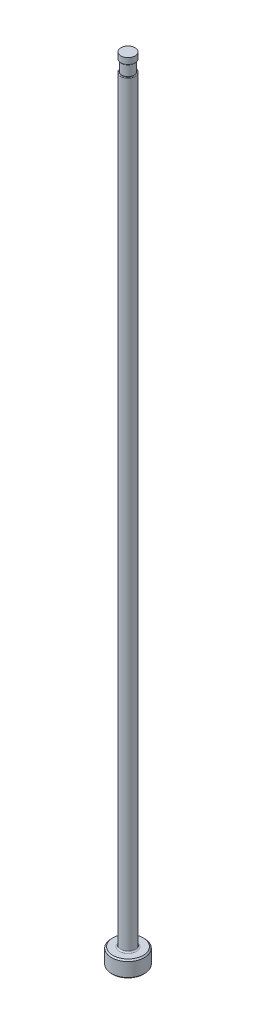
ISO-10303-21;
HEADER;
FILE_DESCRIPTION(('STEP AP214'),'2;1');
FILE_NAME('part.step','',(''),(''),'','','');
FILE_SCHEMA(('AUTOMOTIVE_DESIGN { 1 0 10303 214 1 1 1 1 }'));
ENDSEC;
DATA;
#1=APPLICATION_CONTEXT('core data for automotive mechanical design processes');
#2=APPLICATION_PROTOCOL_DEFINITION('international standard','automotive_design',2000,#1);
#3=PRODUCT_CONTEXT('',#1,'mechanical');
#4=PRODUCT('Part','Part','',(#3));
#5=PRODUCT_RELATED_PRODUCT_CATEGORY('part','',(#4));
#6=PRODUCT_DEFINITION_FORMATION('','',#4);
#7=PRODUCT_DEFINITION_CONTEXT('part definition',#1,'design');
#8=PRODUCT_DEFINITION('design','',#6,#7);
#9=PRODUCT_DEFINITION_SHAPE('','',#8);
#10=(LENGTH_UNIT() NAMED_UNIT(*) SI_UNIT(.MILLI.,.METRE.));
#11=(NAMED_UNIT(*) PLANE_ANGLE_UNIT() SI_UNIT($,.RADIAN.));
#12=(NAMED_UNIT(*) SI_UNIT($,.STERADIAN.) SOLID_ANGLE_UNIT());
#13=UNCERTAINTY_MEASURE_WITH_UNIT(LENGTH_MEASURE(1.E-05),#10,'distance_accuracy_value','');
#14=(GEOMETRIC_REPRESENTATION_CONTEXT(3) GLOBAL_UNCERTAINTY_ASSIGNED_CONTEXT((#13)) GLOBAL_UNIT_ASSIGNED_CONTEXT((#10,
#11,#12)) REPRESENTATION_CONTEXT('',''));
#15=CARTESIAN_POINT('',(0.,0.,0.));
#16=DIRECTION('',(0.,0.,1.));
#17=DIRECTION('',(1.,0.,0.));
#18=AXIS2_PLACEMENT_3D('',#15,#16,#17);
#19=CARTESIAN_POINT('',(-1.38810999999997,151.13,0.));
#20=DIRECTION('',(0.,1.,0.));
#21=DIRECTION('',(0.,0.,1.));
#22=AXIS2_PLACEMENT_3D('',#19,#20,#21);
#23=PLANE('',#22);
#24=CARTESIAN_POINT('',(0.,151.13,0.));
#25=DIRECTION('',(0.,1.,0.));
#26=DIRECTION('',(0.,0.,1.));
#27=AXIS2_PLACEMENT_3D('',#24,#25,#26);
#28=CIRCLE('',#27,1.24205999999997);
#29=CARTESIAN_POINT('',(0.,151.13,1.24205999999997));
#30=VERTEX_POINT('',#29);
#31=EDGE_CURVE('E11',#30,#30,#28,.F.);
#32=ORIENTED_EDGE('',*,*,#31,.T.);
#33=EDGE_LOOP('',(#32));
#34=FACE_BOUND('',#33,.T.);
#35=CARTESIAN_POINT('',(0.,151.13,0.));
#36=DIRECTION('',(0.,1.,0.));
#37=DIRECTION('',(0.,0.,1.));
#38=AXIS2_PLACEMENT_3D('',#35,#36,#37);
#39=CIRCLE('',#38,1.18490999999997);
#40=CARTESIAN_POINT('',(0.,151.13,1.18490999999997));
#41=VERTEX_POINT('',#40);
#42=EDGE_CURVE('E78',#41,#41,#39,.T.);
#43=ORIENTED_EDGE('',*,*,#42,.T.);
#44=EDGE_LOOP('',(#43));
#45=FACE_BOUND('',#44,.T.);
#46=ADVANCED_FACE('F36',(#34,#45),#23,.F.);
#47=CARTESIAN_POINT('',(0.,259.958771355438,0.));
#48=DIRECTION('',(0.,1.,0.));
#49=DIRECTION('',(0.,0.,1.));
#50=AXIS2_PLACEMENT_3D('',#47,#48,#49);
#51=CYLINDRICAL_SURFACE('',#50,1.38810999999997);
#52=DIRECTION('',(0.,1.,0.));
#53=VECTOR('',#52,1.);
#54=CARTESIAN_POINT('',(-1.18490999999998,259.958771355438,-0.723075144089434));
#55=LINE('',#54,#53);
#56=CARTESIAN_POINT('',(-1.18490999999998,148.971,-0.723075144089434));
#57=VERTEX_POINT('',#56);
#58=CARTESIAN_POINT('',(-1.18490999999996,86.614,-0.723075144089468));
#59=VERTEX_POINT('',#58);
#60=EDGE_CURVE('E73',#57,#59,#55,.F.);
#61=ORIENTED_EDGE('',*,*,#60,.F.);
#62=CARTESIAN_POINT('',(0.,148.971,0.));
#63=DIRECTION('',(0.,-1.,0.));
#64=DIRECTION('',(0.,0.,-1.));
#65=AXIS2_PLACEMENT_3D('',#62,#63,#64);
#66=CIRCLE('',#65,1.38810999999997);
#67=CARTESIAN_POINT('',(-1.18490999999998,148.971,0.723075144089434));
#68=VERTEX_POINT('',#67);
#69=EDGE_CURVE('E51',#57,#68,#66,.T.);
#70=ORIENTED_EDGE('',*,*,#69,.T.);
#71=DIRECTION('',(0.,1.,0.));
#72=VECTOR('',#71,1.);
#73=CARTESIAN_POINT('',(-1.18490999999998,259.958771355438,0.723075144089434));
#74=LINE('',#73,#72);
#75=CARTESIAN_POINT('',(-1.18490999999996,86.614,0.723075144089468));
#76=VERTEX_POINT('',#75);
#77=EDGE_CURVE('E84',#76,#68,#74,.T.);
#78=ORIENTED_EDGE('',*,*,#77,.F.);
#79=CARTESIAN_POINT('',(-1.18490999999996,86.614,-0.723075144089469));
#80=CARTESIAN_POINT('',(-1.18490489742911,86.5732205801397,-0.723062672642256));
#81=CARTESIAN_POINT('',(-1.18569554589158,86.5324368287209,-0.721787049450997));
#82=CARTESIAN_POINT('',(-1.18883387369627,86.4510484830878,-0.716617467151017));
#83=CARTESIAN_POINT('',(-1.1911833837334,86.4104441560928,-0.712720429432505));
#84=CARTESIAN_POINT('',(-1.19743938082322,86.3292508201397,-0.702157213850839));
#85=CARTESIAN_POINT('',(-1.20136288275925,86.2886669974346,-0.695460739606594));
#86=CARTESIAN_POINT('',(-1.21067765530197,86.2082938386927,-0.67911480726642));
#87=CARTESIAN_POINT('',(-1.2160681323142,86.1685040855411,-0.669466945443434));
#88=CARTESIAN_POINT('',(-1.23107456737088,86.0713821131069,-0.641613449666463));
#89=CARTESIAN_POINT('',(-1.24148150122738,86.0146925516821,-0.621519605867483));
#90=CARTESIAN_POINT('',(-1.26447851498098,85.9054679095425,-0.573286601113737));
#91=CARTESIAN_POINT('',(-1.27705975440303,85.8529172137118,-0.545179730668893));
#92=CARTESIAN_POINT('',(-1.299036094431,85.7696552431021,-0.48983438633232));
#93=CARTESIAN_POINT('',(-1.30819937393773,85.7372483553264,-0.465065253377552));
#94=CARTESIAN_POINT('',(-1.32626857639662,85.6766429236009,-0.410706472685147));
#95=CARTESIAN_POINT('',(-1.3351748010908,85.6484392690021,-0.381122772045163));
#96=CARTESIAN_POINT('',(-1.35001998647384,85.6032436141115,-0.323985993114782));
#97=CARTESIAN_POINT('',(-1.35618457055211,85.5851455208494,-0.297371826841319));
#98=CARTESIAN_POINT('',(-1.36726162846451,85.553356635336,-0.241365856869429));
#99=CARTESIAN_POINT('',(-1.37217474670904,85.539663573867,-0.21197549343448));
#100=CARTESIAN_POINT('',(-1.38024868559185,85.5174660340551,-0.150740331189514));
#101=CARTESIAN_POINT('',(-1.38339384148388,85.5090078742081,-0.118876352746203));
#102=CARTESIAN_POINT('',(-1.38743875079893,85.4981704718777,-0.0539942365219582));
#103=CARTESIAN_POINT('',(-1.38834050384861,85.4957858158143,-0.0209771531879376));
#104=CARTESIAN_POINT('',(-1.38781595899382,85.4971829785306,0.0402827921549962));
#105=CARTESIAN_POINT('',(-1.38669623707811,85.5001526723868,0.0685504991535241));
#106=CARTESIAN_POINT('',(-1.38282885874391,85.5105312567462,0.124136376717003));
#107=CARTESIAN_POINT('',(-1.38008112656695,85.5179403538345,0.15145450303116));
#108=CARTESIAN_POINT('',(-1.37323772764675,85.536729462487,0.204400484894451));
#109=CARTESIAN_POINT('',(-1.36914590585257,85.5480981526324,0.230032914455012));
#110=CARTESIAN_POINT('',(-1.35995546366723,85.5742451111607,0.279283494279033));
#111=CARTESIAN_POINT('',(-1.35485642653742,85.5890247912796,0.302900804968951));
#112=CARTESIAN_POINT('',(-1.34133825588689,85.6293722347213,0.358961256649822));
#113=CARTESIAN_POINT('',(-1.33251649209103,85.6566776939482,0.390059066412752));
#114=CARTESIAN_POINT('',(-1.31441262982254,85.7159257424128,0.447296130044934));
#115=CARTESIAN_POINT('',(-1.3051296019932,85.747877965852,0.473424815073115));
#116=CARTESIAN_POINT('',(-1.28282911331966,85.8299694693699,0.531562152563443));
#117=CARTESIAN_POINT('',(-1.26997193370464,85.8819111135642,0.561075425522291));
#118=CARTESIAN_POINT('',(-1.24628723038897,85.9902374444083,0.611885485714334));
#119=CARTESIAN_POINT('',(-1.23546851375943,86.0466399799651,0.633147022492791));
#120=CARTESIAN_POINT('',(-1.2193975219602,86.1454407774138,0.663412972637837));
#121=CARTESIAN_POINT('',(-1.21343915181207,86.1872026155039,0.674183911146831));
#122=CARTESIAN_POINT('',(-1.20313242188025,86.2716684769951,0.692410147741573));
#123=CARTESIAN_POINT('',(-1.19878518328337,86.3143731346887,0.699863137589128));
#124=CARTESIAN_POINT('',(-1.19185743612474,86.3998039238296,0.711598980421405));
#125=CARTESIAN_POINT('',(-1.18925556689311,86.4425231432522,0.715920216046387));
#126=CARTESIAN_POINT('',(-1.18577996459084,86.5281637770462,0.721648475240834));
#127=CARTESIAN_POINT('',(-1.18490366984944,86.5710847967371,0.723059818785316));
#128=CARTESIAN_POINT('',(-1.18490999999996,86.614,0.723075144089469));
#129=B_SPLINE_CURVE_WITH_KNOTS('',3,(#79,#80,#81,#82,#83,#84,#85,#86,#87,#88,#89,#90,#91,#92,
#93,#94,#95,#96,#97,#98,#99,#100,#101,#102,#103,#104,#105,#106,#107,#108,#109,#110,#111,#112,
#113,#114,#115,#116,#117,#118,#119,#120,#121,#122,#123,#124,#125,#126,#127,#128),.UNSPECIFIED.,
.F.,.F.,(4,2,2,2,2,2,2,2,2,2,2,2,2,2,2,2,2,2,2,2,2,2,2,2,4),(0.,0.122317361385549,
0.244778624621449,0.368600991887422,0.492356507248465,0.674882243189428,0.856682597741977,
0.981714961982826,1.10659403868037,1.20453097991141,1.30241738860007,1.40115795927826,
1.49981048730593,1.58473133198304,1.66965612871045,1.75434007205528,1.83905912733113,
1.96528739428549,2.09178120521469,2.27410969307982,2.45720871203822,2.58766049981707,
2.71820289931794,2.84711699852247,2.97583957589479),.UNSPECIFIED.);
#130=EDGE_CURVE('E81',#59,#76,#129,.T.);
#131=ORIENTED_EDGE('',*,*,#130,.F.);
#132=EDGE_LOOP('',(#61,#70,#78,#131));
#133=FACE_BOUND('',#132,.T.);
#134=CARTESIAN_POINT('',(0.,3.42900000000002,0.));
#135=DIRECTION('',(0.,1.,0.));
#136=DIRECTION('',(0.,0.,1.));
#137=AXIS2_PLACEMENT_3D('',#134,#135,#136);
#138=CIRCLE('',#137,1.38810999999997);
#139=CARTESIAN_POINT('',(0.,3.42900000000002,1.38810999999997));
#140=VERTEX_POINT('',#139);
#141=EDGE_CURVE('E116',#140,#140,#138,.T.);
#142=ORIENTED_EDGE('',*,*,#141,.T.);
#143=EDGE_LOOP('',(#142));
#144=FACE_BOUND('',#143,.T.);
#145=ADVANCED_FACE('F82',(#133,#144),#51,.T.);
#146=CARTESIAN_POINT('',(0.,0.,0.));
#147=DIRECTION('',(0.,-1.,0.));
#148=DIRECTION('',(0.,0.,-1.));
#149=AXIS2_PLACEMENT_3D('',#146,#147,#148);
#150=PLANE('',#149);
#151=CARTESIAN_POINT('',(0.,0.,0.));
#152=DIRECTION('',(0.,-1.,0.));
#153=DIRECTION('',(0.,0.,-1.));
#154=AXIS2_PLACEMENT_3D('',#151,#152,#153);
#155=CIRCLE('',#154,2.92099999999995);
#156=CARTESIAN_POINT('',(0.,0.,-2.92099999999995));
#157=VERTEX_POINT('',#156);
#158=EDGE_CURVE('E113',#157,#157,#155,.T.);
#159=ORIENTED_EDGE('',*,*,#158,.T.);
#160=EDGE_LOOP('',(#159));
#161=FACE_BOUND('',#160,.T.);
#162=ADVANCED_FACE('F192',(#161),#150,.T.);
#163=CARTESIAN_POINT('',(0.,259.958771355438,0.));
#164=DIRECTION('',(0.,1.,0.));
#165=DIRECTION('',(0.,0.,1.));
#166=AXIS2_PLACEMENT_3D('',#163,#164,#165);
#167=CYLINDRICAL_SURFACE('',#166,3.17499999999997);
#168=CARTESIAN_POINT('',(0.,2.92100000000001,0.));
#169=DIRECTION('',(0.,1.,0.));
#170=DIRECTION('',(0.,0.,1.));
#171=AXIS2_PLACEMENT_3D('',#168,#169,#170);
#172=CIRCLE('',#171,3.17499999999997);
#173=CARTESIAN_POINT('',(0.,2.92100000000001,3.17499999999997));
#174=VERTEX_POINT('',#173);
#175=EDGE_CURVE('E110',#174,#174,#172,.F.);
#176=ORIENTED_EDGE('',*,*,#175,.T.);
#177=EDGE_LOOP('',(#176));
#178=FACE_BOUND('',#177,.T.);
#179=CARTESIAN_POINT('',(0.,0.254000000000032,0.));
#180=DIRECTION('',(0.,-1.,0.));
#181=DIRECTION('',(0.,0.,-1.));
#182=AXIS2_PLACEMENT_3D('',#179,#180,#181);
#183=CIRCLE('',#182,3.17499999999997);
#184=CARTESIAN_POINT('',(0.,0.254000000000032,-3.17499999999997));
#185=VERTEX_POINT('',#184);
#186=EDGE_CURVE('E107',#185,#185,#183,.F.);
#187=ORIENTED_EDGE('',*,*,#186,.T.);
#188=EDGE_LOOP('',(#187));
#189=FACE_BOUND('',#188,.T.);
#190=ADVANCED_FACE('F195',(#178,#189),#167,.T.);
#191=CARTESIAN_POINT('',(-3.17499999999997,3.175,0.));
#192=DIRECTION('',(0.,1.,0.));
#193=DIRECTION('',(0.,0.,1.));
#194=AXIS2_PLACEMENT_3D('',#191,#192,#193);
#195=PLANE('',#194);
#196=CARTESIAN_POINT('',(0.,3.175,0.));
#197=DIRECTION('',(0.,1.,0.));
#198=DIRECTION('',(0.,0.,1.));
#199=AXIS2_PLACEMENT_3D('',#196,#197,#198);
#200=CIRCLE('',#199,1.64210999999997);
#201=CARTESIAN_POINT('',(0.,3.175,1.64210999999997));
#202=VERTEX_POINT('',#201);
#203=EDGE_CURVE('E87',#202,#202,#200,.F.);
#204=ORIENTED_EDGE('',*,*,#203,.T.);
#205=EDGE_LOOP('',(#204));
#206=FACE_BOUND('',#205,.T.);
#207=CARTESIAN_POINT('',(0.,3.175,0.));
#208=DIRECTION('',(0.,1.,0.));
#209=DIRECTION('',(0.,0.,1.));
#210=AXIS2_PLACEMENT_3D('',#207,#208,#209);
#211=CIRCLE('',#210,2.92099999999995);
#212=CARTESIAN_POINT('',(0.,3.175,2.92099999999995));
#213=VERTEX_POINT('',#212);
#214=EDGE_CURVE('E104',#213,#213,#211,.T.);
#215=ORIENTED_EDGE('',*,*,#214,.T.);
#216=EDGE_LOOP('',(#215));
#217=FACE_BOUND('',#216,.T.);
#218=ADVANCED_FACE('F190',(#206,#217),#195,.T.);
#219=CARTESIAN_POINT('',(0.,3.17499999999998,0.));
#220=DIRECTION('',(0.,-1.,0.));
#221=DIRECTION('',(0.,0.,-1.));
#222=AXIS2_PLACEMENT_3D('',#219,#220,#221);
#223=CONICAL_SURFACE('',#222,2.92099999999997,0.7853981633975);
#224=ORIENTED_EDGE('',*,*,#175,.F.);
#225=EDGE_LOOP('',(#224));
#226=FACE_BOUND('',#225,.T.);
#227=ORIENTED_EDGE('',*,*,#214,.F.);
#228=EDGE_LOOP('',(#227));
#229=FACE_BOUND('',#228,.T.);
#230=ADVANCED_FACE('F186',(#226,#229),#223,.T.);
#231=CARTESIAN_POINT('',(0.,0.254000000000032,0.));
#232=DIRECTION('',(0.,1.,0.));
#233=DIRECTION('',(0.,0.,1.));
#234=AXIS2_PLACEMENT_3D('',#231,#232,#233);
#235=CONICAL_SURFACE('',#234,3.17499999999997,0.785398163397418);
#236=ORIENTED_EDGE('',*,*,#158,.F.);
#237=EDGE_LOOP('',(#236));
#238=FACE_BOUND('',#237,.T.);
#239=ORIENTED_EDGE('',*,*,#186,.F.);
#240=EDGE_LOOP('',(#239));
#241=FACE_BOUND('',#240,.T.);
#242=ADVANCED_FACE('F182',(#238,#241),#235,.T.);
#243=CARTESIAN_POINT('',(0.,3.42900000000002,0.));
#244=DIRECTION('',(0.,1.,0.));
#245=DIRECTION('',(0.,0.,1.));
#246=AXIS2_PLACEMENT_3D('',#243,#244,#245);
#247=TOROIDAL_SURFACE('',#246,1.64210999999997,0.254);
#248=ORIENTED_EDGE('',*,*,#203,.F.);
#249=EDGE_LOOP('',(#248));
#250=FACE_BOUND('',#249,.T.);
#251=ORIENTED_EDGE('',*,*,#141,.F.);
#252=EDGE_LOOP('',(#251));
#253=FACE_BOUND('',#252,.T.);
#254=ADVANCED_FACE('F147',(#250,#253),#247,.F.);
#255=CARTESIAN_POINT('',(-1.38810999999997,149.098,0.));
#256=DIRECTION('',(0.,-1.,0.));
#257=DIRECTION('',(0.,0.,-1.));
#258=AXIS2_PLACEMENT_3D('',#255,#256,#257);
#259=PLANE('',#258);
#260=DIRECTION('',(0.,0.,1.));
#261=VECTOR('',#260,1.);
#262=CARTESIAN_POINT('',(-1.18490999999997,149.098,0.));
#263=LINE('',#262,#261);
#264=CARTESIAN_POINT('',(-1.18490999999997,149.098,0.));
#265=VERTEX_POINT('',#264);
#266=CARTESIAN_POINT('',(-1.18490999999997,149.098,0.431725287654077));
#267=VERTEX_POINT('',#266);
#268=EDGE_CURVE('E90',#265,#267,#263,.T.);
#269=ORIENTED_EDGE('',*,*,#268,.T.);
#270=CARTESIAN_POINT('',(0.,149.098,0.));
#271=DIRECTION('',(0.,-1.,0.));
#272=DIRECTION('',(0.,0.,-1.));
#273=AXIS2_PLACEMENT_3D('',#270,#271,#272);
#274=CIRCLE('',#273,1.26110999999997);
#275=CARTESIAN_POINT('',(-1.18490999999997,149.098,-0.431725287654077));
#276=VERTEX_POINT('',#275);
#277=EDGE_CURVE('E86',#267,#276,#274,.F.);
#278=ORIENTED_EDGE('',*,*,#277,.T.);
#279=EDGE_CURVE('E79',#276,#265,#263,.T.);
#280=ORIENTED_EDGE('',*,*,#279,.T.);
#281=CARTESIAN_POINT('',(0.,149.098,0.));
#282=DIRECTION('',(0.,1.,0.));
#283=DIRECTION('',(0.,0.,1.));
#284=AXIS2_PLACEMENT_3D('',#281,#282,#283);
#285=CIRCLE('',#284,1.18490999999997);
#286=EDGE_CURVE('E101',#265,#265,#285,.T.);
#287=ORIENTED_EDGE('',*,*,#286,.F.);
#288=EDGE_LOOP('',(#269,#278,#280,#287));
#289=FACE_BOUND('',#288,.T.);
#290=ADVANCED_FACE('F144',(#289),#259,.F.);
#291=CARTESIAN_POINT('',(0.,153.448281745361,0.));
#292=DIRECTION('',(0.,1.,0.));
#293=DIRECTION('',(0.,0.,1.));
#294=AXIS2_PLACEMENT_3D('',#291,#292,#293);
#295=CYLINDRICAL_SURFACE('',#294,1.18490999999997);
#296=ORIENTED_EDGE('',*,*,#42,.F.);
#297=EDGE_LOOP('',(#296));
#298=FACE_BOUND('',#297,.T.);
#299=ORIENTED_EDGE('',*,*,#286,.T.);
#300=EDGE_LOOP('',(#299));
#301=FACE_BOUND('',#300,.T.);
#302=ADVANCED_FACE('F141',(#298,#301),#295,.T.);
#303=CARTESIAN_POINT('',(-1.18490999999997,150.114,-3.17499999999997));
#304=DIRECTION('',(1.,0.,0.));
#305=DIRECTION('',(0.,1.,0.));
#306=AXIS2_PLACEMENT_3D('',#303,#304,#305);
#307=PLANE('',#306);
#308=ORIENTED_EDGE('',*,*,#279,.F.);
#309=CARTESIAN_POINT('',(-1.18490999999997,149.098,-0.431725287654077));
#310=CARTESIAN_POINT('',(-1.18490999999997,149.097996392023,-0.443927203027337));
#311=CARTESIAN_POINT('',(-1.18490999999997,149.097793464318,-0.456134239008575));
#312=CARTESIAN_POINT('',(-1.18490999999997,149.096871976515,-0.48055975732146));
#313=CARTESIAN_POINT('',(-1.18490999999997,149.096152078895,-0.492778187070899));
#314=CARTESIAN_POINT('',(-1.18490999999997,149.094068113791,-0.517285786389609));
#315=CARTESIAN_POINT('',(-1.18490999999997,149.092697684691,-0.529574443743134));
#316=CARTESIAN_POINT('',(-1.18490999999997,149.089154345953,-0.554026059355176));
#317=CARTESIAN_POINT('',(-1.18490999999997,149.086982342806,-0.566189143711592));
#318=CARTESIAN_POINT('',(-1.18490999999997,149.08185310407,-0.589290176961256));
#319=CARTESIAN_POINT('',(-1.18490999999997,149.078976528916,-0.600245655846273));
#320=CARTESIAN_POINT('',(-1.18490999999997,149.072158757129,-0.621829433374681));
#321=CARTESIAN_POINT('',(-1.18490999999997,149.06821796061,-0.632457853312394));
#322=CARTESIAN_POINT('',(-1.18490999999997,149.059651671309,-0.651596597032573));
#323=CARTESIAN_POINT('',(-1.18490999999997,149.055211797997,-0.660188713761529));
#324=CARTESIAN_POINT('',(-1.18490999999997,149.045086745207,-0.676609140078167));
#325=CARTESIAN_POINT('',(-1.18490999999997,149.039405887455,-0.684439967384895));
#326=CARTESIAN_POINT('',(-1.18490999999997,149.029548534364,-0.695366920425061));
#327=CARTESIAN_POINT('',(-1.18490999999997,149.025921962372,-0.698957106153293));
#328=CARTESIAN_POINT('',(-1.18490999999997,149.018202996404,-0.705604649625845));
#329=CARTESIAN_POINT('',(-1.18490999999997,149.014110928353,-0.708662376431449));
#330=CARTESIAN_POINT('',(-1.18490999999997,149.006145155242,-0.713626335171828));
#331=CARTESIAN_POINT('',(-1.18490999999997,149.002337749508,-0.715637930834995));
#332=CARTESIAN_POINT('',(-1.18490999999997,148.994445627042,-0.719002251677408));
#333=CARTESIAN_POINT('',(-1.18490999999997,148.990361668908,-0.720356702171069));
#334=CARTESIAN_POINT('',(-1.18490999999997,148.983704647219,-0.721899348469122));
#335=CARTESIAN_POINT('',(-1.18490999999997,148.98118800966,-0.722337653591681));
#336=CARTESIAN_POINT('',(-1.18490999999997,148.976115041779,-0.722926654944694));
#337=CARTESIAN_POINT('',(-1.18490999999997,148.97355862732,-0.723076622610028));
#338=CARTESIAN_POINT('',(-1.18490999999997,148.971000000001,-0.723075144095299));
#339=B_SPLINE_CURVE_WITH_KNOTS('',3,(#309,#310,#311,#312,#313,#314,#315,#316,#317,#318,#319,
#320,#321,#322,#323,#324,#325,#326,#327,#328,#329,#330,#331,#332,#333,#334,#335,#336,#337,#338),
.UNSPECIFIED.,.F.,.F.,(4,2,2,2,2,2,2,2,2,2,2,2,2,2,4),(0.,0.0366119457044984,0.0733189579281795,
0.110392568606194,0.14742438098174,0.181365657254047,0.215294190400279,0.244238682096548,
0.273083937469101,0.288356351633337,0.303618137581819,0.316487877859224,0.329323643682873,
0.336971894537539,0.344639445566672),.UNSPECIFIED.);
#340=EDGE_CURVE('E59',#276,#57,#339,.T.);
#341=ORIENTED_EDGE('',*,*,#340,.T.);
#342=ORIENTED_EDGE('',*,*,#60,.T.);
#343=DIRECTION('',(0.,0.,1.));
#344=VECTOR('',#343,1.);
#345=CARTESIAN_POINT('',(-1.18490999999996,86.614,-3.17499999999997));
#346=LINE('',#345,#344);
#347=EDGE_CURVE('E77',#59,#76,#346,.T.);
#348=ORIENTED_EDGE('',*,*,#347,.T.);
#349=ORIENTED_EDGE('',*,*,#77,.T.);
#350=CARTESIAN_POINT('',(-1.18490999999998,148.971,0.723075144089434));
#351=CARTESIAN_POINT('',(-1.18490999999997,148.974961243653,0.723084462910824));
#352=CARTESIAN_POINT('',(-1.18490999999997,148.978912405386,0.722719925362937));
#353=CARTESIAN_POINT('',(-1.18490999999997,148.986661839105,0.721324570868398));
#354=CARTESIAN_POINT('',(-1.18490999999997,148.990461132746,0.720299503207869));
#355=CARTESIAN_POINT('',(-1.18490999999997,148.997834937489,0.717665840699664));
#356=CARTESIAN_POINT('',(-1.18490999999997,149.001410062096,0.716058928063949));
#357=CARTESIAN_POINT('',(-1.18490999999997,149.008307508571,0.712363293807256));
#358=CARTESIAN_POINT('',(-1.18490999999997,149.011629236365,0.710273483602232));
#359=CARTESIAN_POINT('',(-1.18490999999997,149.020123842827,0.70418693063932));
#360=CARTESIAN_POINT('',(-1.18490999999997,149.025051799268,0.699848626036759));
#361=CARTESIAN_POINT('',(-1.18490999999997,149.034179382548,0.690466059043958));
#362=CARTESIAN_POINT('',(-1.18490999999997,149.038376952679,0.685419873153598));
#363=CARTESIAN_POINT('',(-1.18490999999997,149.048925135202,0.671062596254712));
#364=CARTESIAN_POINT('',(-1.18490999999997,149.05465072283,0.661296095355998));
#365=CARTESIAN_POINT('',(-1.18490999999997,149.06464686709,0.641058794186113));
#366=CARTESIAN_POINT('',(-1.18490999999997,149.068913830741,0.630586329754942));
#367=CARTESIAN_POINT('',(-1.18490999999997,149.080249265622,0.597997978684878));
#368=CARTESIAN_POINT('',(-1.18490999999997,149.085516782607,0.575266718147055));
#369=CARTESIAN_POINT('',(-1.18490999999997,149.093081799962,0.529347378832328));
#370=CARTESIAN_POINT('',(-1.18490999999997,149.095370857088,0.50615818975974));
#371=CARTESIAN_POINT('',(-1.18490999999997,149.097127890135,0.474376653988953));
#372=CARTESIAN_POINT('',(-1.18490999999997,149.097464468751,0.465824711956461));
#373=CARTESIAN_POINT('',(-1.18490999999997,149.097899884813,0.448756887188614));
#374=CARTESIAN_POINT('',(-1.18490999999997,149.097999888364,0.440241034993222));
#375=CARTESIAN_POINT('',(-1.18490999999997,149.098,0.431725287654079));
#376=B_SPLINE_CURVE_WITH_KNOTS('',3,(#350,#351,#352,#353,#354,#355,#356,#357,#358,#359,#360,
#361,#362,#363,#364,#365,#366,#367,#368,#369,#370,#371,#372,#373,#374,#375),.UNSPECIFIED.,.F.,
.F.,(4,2,2,2,2,2,2,2,2,2,2,2,4),(0.,0.0118509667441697,0.0236001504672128,0.0353156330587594,
0.0470577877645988,0.0666403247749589,0.0862771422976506,0.120048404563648,0.153902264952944,
0.223511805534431,0.293318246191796,0.318991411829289,0.344537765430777),.UNSPECIFIED.);
#377=EDGE_CURVE('E172',#68,#267,#376,.T.);
#378=ORIENTED_EDGE('',*,*,#377,.T.);
#379=ORIENTED_EDGE('',*,*,#268,.F.);
#380=EDGE_LOOP('',(#308,#341,#342,#348,#349,#378,#379));
#381=FACE_BOUND('',#380,.T.);
#382=ADVANCED_FACE('F75',(#381),#307,.F.);
#383=CARTESIAN_POINT('',(-4.35990999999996,86.614,-3.17499999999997));
#384=DIRECTION('',(0.,0.,1.));
#385=DIRECTION('',(1.,0.,0.));
#386=AXIS2_PLACEMENT_3D('',#383,#384,#385);
#387=CYLINDRICAL_SURFACE('',#386,3.175);
#388=ORIENTED_EDGE('',*,*,#347,.F.);
#389=ORIENTED_EDGE('',*,*,#130,.T.);
#390=EDGE_LOOP('',(#388,#389));
#391=FACE_BOUND('',#390,.T.);
#392=ADVANCED_FACE('F89',(#391),#387,.F.);
#393=CARTESIAN_POINT('',(0.,152.687735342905,0.));
#394=DIRECTION('',(0.,1.,0.));
#395=DIRECTION('',(0.,0.,1.));
#396=AXIS2_PLACEMENT_3D('',#393,#394,#395);
#397=CYLINDRICAL_SURFACE('',#396,1.36905999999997);
#398=CARTESIAN_POINT('',(0.,151.257,0.));
#399=DIRECTION('',(0.,1.,0.));
#400=DIRECTION('',(0.,0.,1.));
#401=AXIS2_PLACEMENT_3D('',#398,#399,#400);
#402=CIRCLE('',#401,1.36905999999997);
#403=CARTESIAN_POINT('',(0.,151.257,1.36905999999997));
#404=VERTEX_POINT('',#403);
#405=EDGE_CURVE('E44',#404,#404,#402,.T.);
#406=ORIENTED_EDGE('',*,*,#405,.T.);
#407=EDGE_LOOP('',(#406));
#408=FACE_BOUND('',#407,.T.);
#409=CARTESIAN_POINT('',(0.,152.4,0.));
#410=DIRECTION('',(0.,1.,0.));
#411=DIRECTION('',(0.,0.,1.));
#412=AXIS2_PLACEMENT_3D('',#409,#410,#411);
#413=CIRCLE('',#412,1.36905999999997);
#414=CARTESIAN_POINT('',(0.,152.4,1.36905999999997));
#415=VERTEX_POINT('',#414);
#416=EDGE_CURVE('E91',#415,#415,#413,.T.);
#417=ORIENTED_EDGE('',*,*,#416,.F.);
#418=EDGE_LOOP('',(#417));
#419=FACE_BOUND('',#418,.T.);
#420=ADVANCED_FACE('F135',(#408,#419),#397,.T.);
#421=CARTESIAN_POINT('',(-1.38810999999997,152.4,0.));
#422=DIRECTION('',(0.,1.,0.));
#423=DIRECTION('',(0.,0.,1.));
#424=AXIS2_PLACEMENT_3D('',#421,#422,#423);
#425=PLANE('',#424);
#426=ORIENTED_EDGE('',*,*,#416,.T.);
#427=EDGE_LOOP('',(#426));
#428=FACE_BOUND('',#427,.T.);
#429=ADVANCED_FACE('F149',(#428),#425,.T.);
#430=CARTESIAN_POINT('',(0.,148.971,0.));
#431=DIRECTION('',(0.,-1.,0.));
#432=DIRECTION('',(0.,0.,-1.));
#433=AXIS2_PLACEMENT_3D('',#430,#431,#432);
#434=TOROIDAL_SURFACE('',#433,1.26110999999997,0.127);
#435=ORIENTED_EDGE('',*,*,#377,.F.);
#436=ORIENTED_EDGE('',*,*,#69,.F.);
#437=ORIENTED_EDGE('',*,*,#340,.F.);
#438=ORIENTED_EDGE('',*,*,#277,.F.);
#439=EDGE_LOOP('',(#435,#436,#437,#438));
#440=FACE_BOUND('',#439,.T.);
#441=ADVANCED_FACE('F151',(#440),#434,.T.);
#442=CARTESIAN_POINT('',(0.,151.257,0.));
#443=DIRECTION('',(0.,1.,0.));
#444=DIRECTION('',(0.,0.,1.));
#445=AXIS2_PLACEMENT_3D('',#442,#443,#444);
#446=TOROIDAL_SURFACE('',#445,1.24205999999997,0.127);
#447=ORIENTED_EDGE('',*,*,#31,.F.);
#448=EDGE_LOOP('',(#447));
#449=FACE_BOUND('',#448,.T.);
#450=ORIENTED_EDGE('',*,*,#405,.F.);
#451=EDGE_LOOP('',(#450));
#452=FACE_BOUND('',#451,.T.);
#453=ADVANCED_FACE('F38',(#449,#452),#446,.T.);
#454=CLOSED_SHELL('',(#46,#145,#162,#190,#218,#230,#242,#254,#290,#302,#382,#392,#420,#429,#441,#453));
#455=MANIFOLD_SOLID_BREP('B2',#454);
#456=ADVANCED_BREP_SHAPE_REPRESENTATION('',(#18,#455),#14);
#457=SHAPE_DEFINITION_REPRESENTATION(#9,#456);
ENDSEC;
END-ISO-10303-21;
